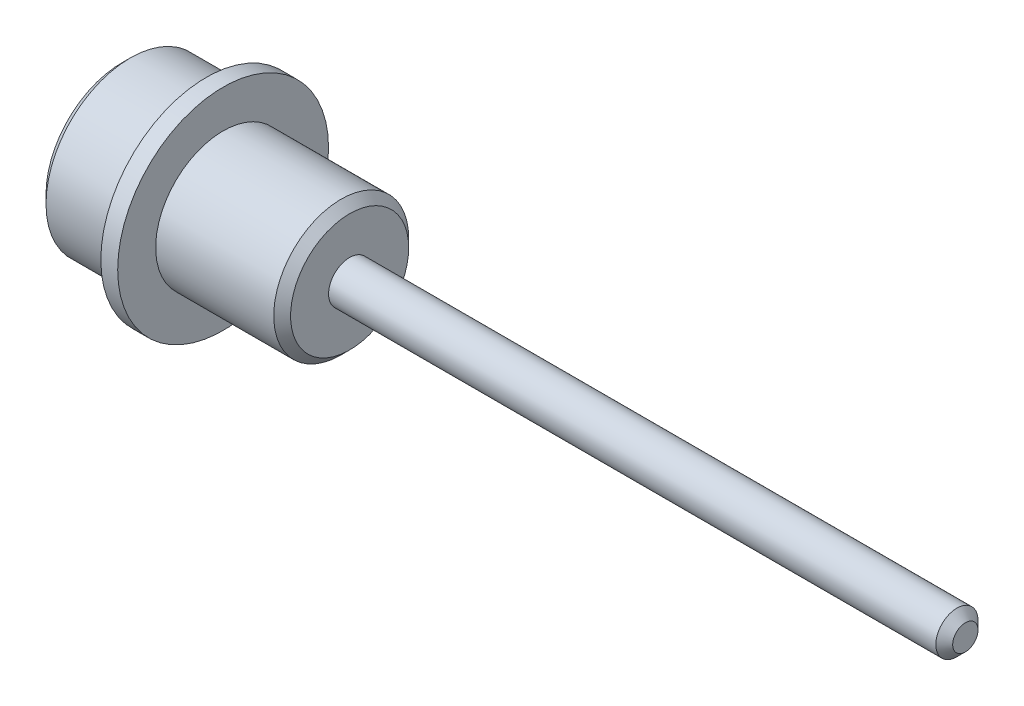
from build123d import *

# Parameters (mm, degrees)
CHAMFER1_SIZE = 1


with BuildPart() as part:
    # Sketch1 → Revolve1 (revolve)
    with BuildSketch(Plane.XY, mode=Mode.PRIVATE) as revolve1_sk:
        Polygon((0, 0), (0, 10), (10, 10), (10, 12.5), (12, 12.5), (12, 8), (27, 8), (27, 2.5), (100, 2.5), (100, 0), align=None)
    revolve(revolve1_sk.sketch.rotate(Axis((81.176121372, 0, 0), (-1, 0, 0)), 90), axis=Axis((81.176121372, 0, 0), (-1, 0, 0)))

    # Chamfer1
    chamfer1_edges = [part.edges().sort_by_distance(p)[0] for p in [
        (100, 0, 2.5),
        (27, 0, 8),
        (0, 0, 10),
    ]]
    chamfer(chamfer1_edges, length=CHAMFER1_SIZE)


solid = part.part
